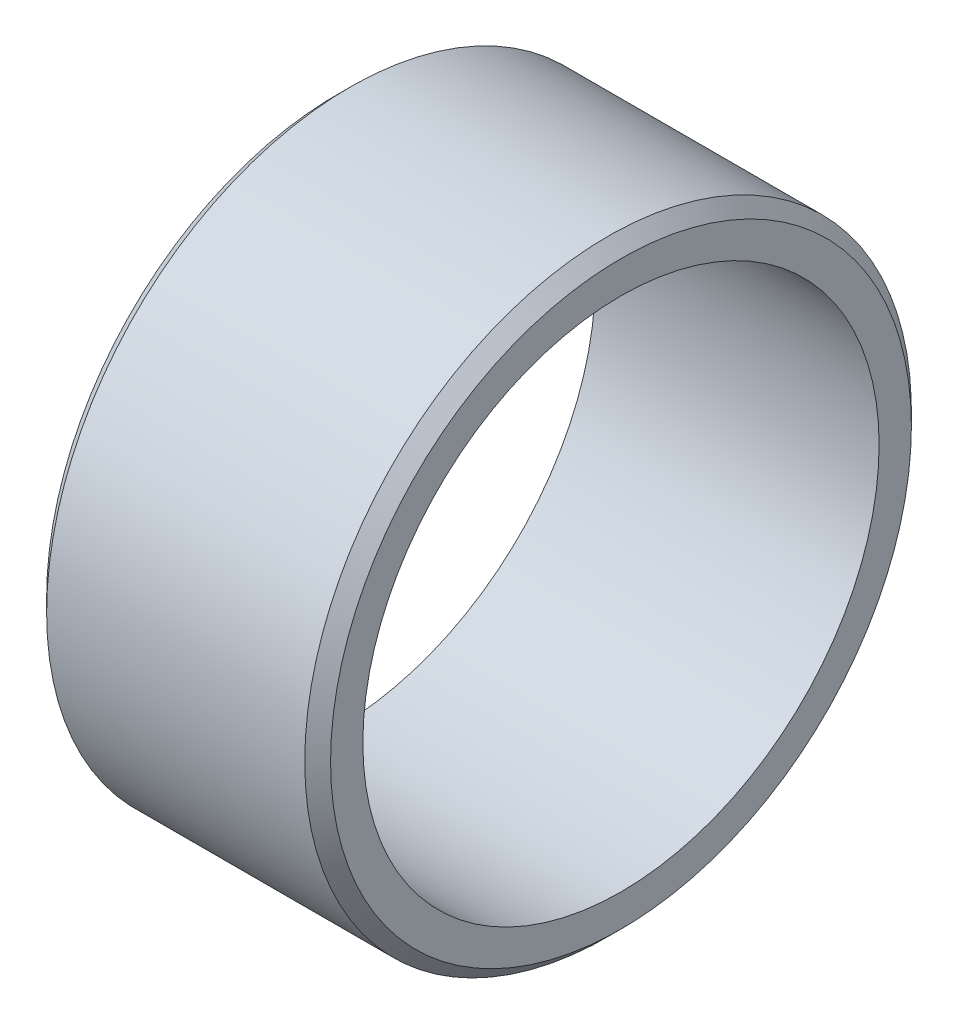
ISO-10303-21;
HEADER;
FILE_DESCRIPTION(('STEP AP214'),'2;1');
FILE_NAME('part.step','',(''),(''),'','','');
FILE_SCHEMA(('AUTOMOTIVE_DESIGN { 1 0 10303 214 1 1 1 1 }'));
ENDSEC;
DATA;
#1=APPLICATION_CONTEXT('core data for automotive mechanical design processes');
#2=APPLICATION_PROTOCOL_DEFINITION('international standard','automotive_design',2000,#1);
#3=PRODUCT_CONTEXT('',#1,'mechanical');
#4=PRODUCT('Part','Part','',(#3));
#5=PRODUCT_RELATED_PRODUCT_CATEGORY('part','',(#4));
#6=PRODUCT_DEFINITION_FORMATION('','',#4);
#7=PRODUCT_DEFINITION_CONTEXT('part definition',#1,'design');
#8=PRODUCT_DEFINITION('design','',#6,#7);
#9=PRODUCT_DEFINITION_SHAPE('','',#8);
#10=(LENGTH_UNIT() NAMED_UNIT(*) SI_UNIT(.MILLI.,.METRE.));
#11=(NAMED_UNIT(*) PLANE_ANGLE_UNIT() SI_UNIT($,.RADIAN.));
#12=(NAMED_UNIT(*) SI_UNIT($,.STERADIAN.) SOLID_ANGLE_UNIT());
#13=UNCERTAINTY_MEASURE_WITH_UNIT(LENGTH_MEASURE(1.E-05),#10,'distance_accuracy_value','');
#14=(GEOMETRIC_REPRESENTATION_CONTEXT(3) GLOBAL_UNCERTAINTY_ASSIGNED_CONTEXT((#13)) GLOBAL_UNIT_ASSIGNED_CONTEXT((#10,
#11,#12)) REPRESENTATION_CONTEXT('',''));
#15=CARTESIAN_POINT('',(0.,0.,0.));
#16=DIRECTION('',(0.,0.,1.));
#17=DIRECTION('',(1.,0.,0.));
#18=AXIS2_PLACEMENT_3D('',#15,#16,#17);
#19=CARTESIAN_POINT('',(0.,22.5,0.));
#20=DIRECTION('',(-1.,0.,0.));
#21=DIRECTION('',(0.,0.,1.));
#22=AXIS2_PLACEMENT_3D('',#19,#20,#21);
#23=PLANE('',#22);
#24=CARTESIAN_POINT('',(0.,0.,0.));
#25=DIRECTION('',(-1.,0.,0.));
#26=DIRECTION('',(0.,0.,1.));
#27=AXIS2_PLACEMENT_3D('',#24,#25,#26);
#28=CIRCLE('',#27,22.5);
#29=CARTESIAN_POINT('',(0.,0.,22.5));
#30=VERTEX_POINT('',#29);
#31=EDGE_CURVE('E10',#30,#30,#28,.T.);
#32=ORIENTED_EDGE('',*,*,#31,.F.);
#33=EDGE_LOOP('',(#32));
#34=FACE_BOUND('',#33,.T.);
#35=CARTESIAN_POINT('',(0.,0.,0.));
#36=DIRECTION('',(-1.,0.,0.));
#37=DIRECTION('',(0.,0.,1.));
#38=AXIS2_PLACEMENT_3D('',#35,#36,#37);
#39=CIRCLE('',#38,20.);
#40=CARTESIAN_POINT('',(0.,0.,20.));
#41=VERTEX_POINT('',#40);
#42=EDGE_CURVE('E51',#41,#41,#39,.T.);
#43=ORIENTED_EDGE('',*,*,#42,.T.);
#44=EDGE_LOOP('',(#43));
#45=FACE_BOUND('',#44,.T.);
#46=ADVANCED_FACE('F29',(#34,#45),#23,.F.);
#47=CARTESIAN_POINT('',(0.,0.,0.));
#48=DIRECTION('',(-1.,0.,0.));
#49=DIRECTION('',(0.,0.,1.));
#50=AXIS2_PLACEMENT_3D('',#47,#48,#49);
#51=CONICAL_SURFACE('',#50,22.5,0.785398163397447);
#52=CARTESIAN_POINT('',(-1.,0.,0.));
#53=DIRECTION('',(-1.,0.,0.));
#54=DIRECTION('',(0.,0.,1.));
#55=AXIS2_PLACEMENT_3D('',#52,#53,#54);
#56=CIRCLE('',#55,23.5);
#57=CARTESIAN_POINT('',(-1.,0.,23.5));
#58=VERTEX_POINT('',#57);
#59=EDGE_CURVE('E35',#58,#58,#56,.T.);
#60=ORIENTED_EDGE('',*,*,#59,.F.);
#61=EDGE_LOOP('',(#60));
#62=FACE_BOUND('',#61,.T.);
#63=ORIENTED_EDGE('',*,*,#31,.T.);
#64=EDGE_LOOP('',(#63));
#65=FACE_BOUND('',#64,.T.);
#66=ADVANCED_FACE('F76',(#62,#65),#51,.T.);
#67=CARTESIAN_POINT('',(-20.663939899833,0.,0.));
#68=DIRECTION('',(-1.,0.,0.));
#69=DIRECTION('',(0.,0.,1.));
#70=AXIS2_PLACEMENT_3D('',#67,#68,#69);
#71=CYLINDRICAL_SURFACE('',#70,23.5);
#72=CARTESIAN_POINT('',(-21.,0.,0.));
#73=DIRECTION('',(-1.,0.,0.));
#74=DIRECTION('',(0.,0.,1.));
#75=AXIS2_PLACEMENT_3D('',#72,#73,#74);
#76=CIRCLE('',#75,23.5);
#77=CARTESIAN_POINT('',(-21.,0.,23.5));
#78=VERTEX_POINT('',#77);
#79=EDGE_CURVE('E39',#78,#78,#76,.T.);
#80=ORIENTED_EDGE('',*,*,#79,.F.);
#81=EDGE_LOOP('',(#80));
#82=FACE_BOUND('',#81,.T.);
#83=ORIENTED_EDGE('',*,*,#59,.T.);
#84=EDGE_LOOP('',(#83));
#85=FACE_BOUND('',#84,.T.);
#86=ADVANCED_FACE('F71',(#82,#85),#71,.T.);
#87=CARTESIAN_POINT('',(-21.,0.,0.));
#88=DIRECTION('',(1.,0.,0.));
#89=DIRECTION('',(0.,0.,-1.));
#90=AXIS2_PLACEMENT_3D('',#87,#88,#89);
#91=CONICAL_SURFACE('',#90,23.5,0.785398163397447);
#92=CARTESIAN_POINT('',(-22.,0.,0.));
#93=DIRECTION('',(-1.,0.,0.));
#94=DIRECTION('',(0.,0.,1.));
#95=AXIS2_PLACEMENT_3D('',#92,#93,#94);
#96=CIRCLE('',#95,22.5);
#97=CARTESIAN_POINT('',(-22.,0.,22.5));
#98=VERTEX_POINT('',#97);
#99=EDGE_CURVE('E43',#98,#98,#96,.T.);
#100=ORIENTED_EDGE('',*,*,#99,.F.);
#101=EDGE_LOOP('',(#100));
#102=FACE_BOUND('',#101,.T.);
#103=ORIENTED_EDGE('',*,*,#79,.T.);
#104=EDGE_LOOP('',(#103));
#105=FACE_BOUND('',#104,.T.);
#106=ADVANCED_FACE('F65',(#102,#105),#91,.T.);
#107=CARTESIAN_POINT('',(-22.,22.5,0.));
#108=DIRECTION('',(1.,0.,0.));
#109=DIRECTION('',(0.,0.,-1.));
#110=AXIS2_PLACEMENT_3D('',#107,#108,#109);
#111=PLANE('',#110);
#112=CARTESIAN_POINT('',(-22.,0.,0.));
#113=DIRECTION('',(-1.,0.,0.));
#114=DIRECTION('',(0.,0.,1.));
#115=AXIS2_PLACEMENT_3D('',#112,#113,#114);
#116=CIRCLE('',#115,20.);
#117=CARTESIAN_POINT('',(-22.,0.,20.));
#118=VERTEX_POINT('',#117);
#119=EDGE_CURVE('E48',#118,#118,#116,.T.);
#120=ORIENTED_EDGE('',*,*,#119,.F.);
#121=EDGE_LOOP('',(#120));
#122=FACE_BOUND('',#121,.T.);
#123=ORIENTED_EDGE('',*,*,#99,.T.);
#124=EDGE_LOOP('',(#123));
#125=FACE_BOUND('',#124,.T.);
#126=ADVANCED_FACE('F59',(#122,#125),#111,.F.);
#127=CARTESIAN_POINT('',(-20.663939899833,0.,0.));
#128=DIRECTION('',(-1.,0.,0.));
#129=DIRECTION('',(0.,0.,1.));
#130=AXIS2_PLACEMENT_3D('',#127,#128,#129);
#131=CYLINDRICAL_SURFACE('',#130,20.);
#132=ORIENTED_EDGE('',*,*,#42,.F.);
#133=EDGE_LOOP('',(#132));
#134=FACE_BOUND('',#133,.T.);
#135=ORIENTED_EDGE('',*,*,#119,.T.);
#136=EDGE_LOOP('',(#135));
#137=FACE_BOUND('',#136,.T.);
#138=ADVANCED_FACE('F56',(#134,#137),#131,.F.);
#139=CLOSED_SHELL('',(#46,#66,#86,#106,#126,#138));
#140=MANIFOLD_SOLID_BREP('B2',#139);
#141=ADVANCED_BREP_SHAPE_REPRESENTATION('',(#18,#140),#14);
#142=SHAPE_DEFINITION_REPRESENTATION(#9,#141);
ENDSEC;
END-ISO-10303-21;
